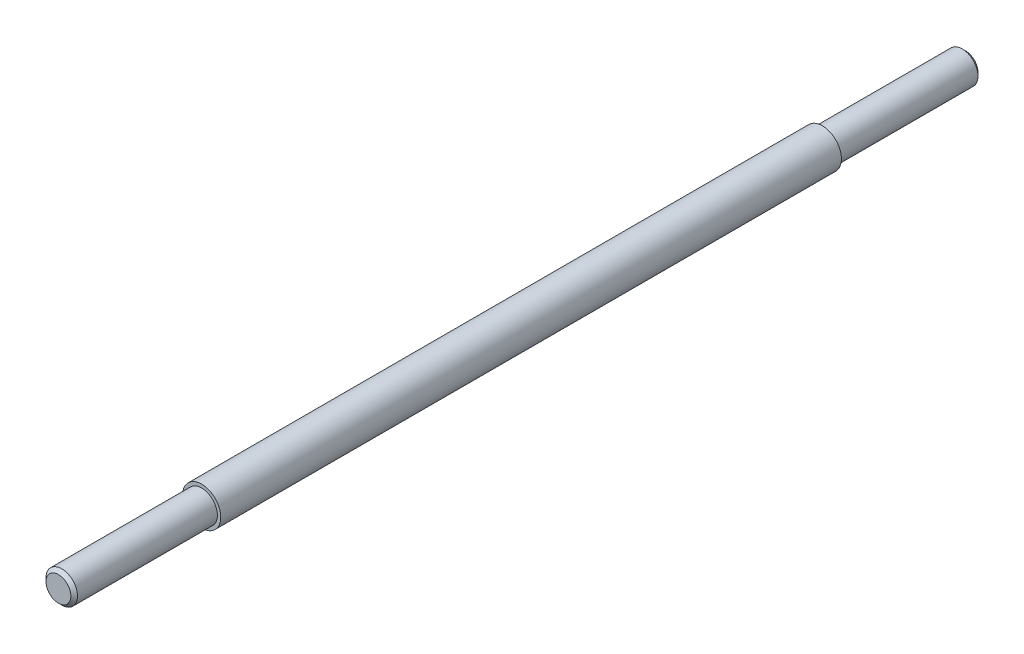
ISO-10303-21;
HEADER;
FILE_DESCRIPTION(('STEP AP214'),'2;1');
FILE_NAME('part.step','',(''),(''),'','','');
FILE_SCHEMA(('AUTOMOTIVE_DESIGN { 1 0 10303 214 1 1 1 1 }'));
ENDSEC;
DATA;
#1=APPLICATION_CONTEXT('core data for automotive mechanical design processes');
#2=APPLICATION_PROTOCOL_DEFINITION('international standard','automotive_design',2000,#1);
#3=PRODUCT_CONTEXT('',#1,'mechanical');
#4=PRODUCT('Part','Part','',(#3));
#5=PRODUCT_RELATED_PRODUCT_CATEGORY('part','',(#4));
#6=PRODUCT_DEFINITION_FORMATION('','',#4);
#7=PRODUCT_DEFINITION_CONTEXT('part definition',#1,'design');
#8=PRODUCT_DEFINITION('design','',#6,#7);
#9=PRODUCT_DEFINITION_SHAPE('','',#8);
#10=(LENGTH_UNIT() NAMED_UNIT(*) SI_UNIT(.MILLI.,.METRE.));
#11=(NAMED_UNIT(*) PLANE_ANGLE_UNIT() SI_UNIT($,.RADIAN.));
#12=(NAMED_UNIT(*) SI_UNIT($,.STERADIAN.) SOLID_ANGLE_UNIT());
#13=UNCERTAINTY_MEASURE_WITH_UNIT(LENGTH_MEASURE(1.E-05),#10,'distance_accuracy_value','');
#14=(GEOMETRIC_REPRESENTATION_CONTEXT(3) GLOBAL_UNCERTAINTY_ASSIGNED_CONTEXT((#13)) GLOBAL_UNIT_ASSIGNED_CONTEXT((#10,
#11,#12)) REPRESENTATION_CONTEXT('',''));
#15=CARTESIAN_POINT('',(0.,0.,0.));
#16=DIRECTION('',(0.,0.,1.));
#17=DIRECTION('',(1.,0.,0.));
#18=AXIS2_PLACEMENT_3D('',#15,#16,#17);
#19=CARTESIAN_POINT('',(0.,0.,95.));
#20=DIRECTION('',(0.,0.,-1.));
#21=DIRECTION('',(-1.,0.,0.));
#22=AXIS2_PLACEMENT_3D('',#19,#20,#21);
#23=CYLINDRICAL_SURFACE('',#22,2.);
#24=CARTESIAN_POINT('',(0.,0.,80.));
#25=DIRECTION('',(0.,0.,1.));
#26=DIRECTION('',(1.,0.,0.));
#27=AXIS2_PLACEMENT_3D('',#24,#25,#26);
#28=CIRCLE('',#27,2.);
#29=CARTESIAN_POINT('',(2.,0.,80.));
#30=VERTEX_POINT('',#29);
#31=EDGE_CURVE('E48',#30,#30,#28,.T.);
#32=ORIENTED_EDGE('',*,*,#31,.F.);
#33=EDGE_LOOP('',(#32));
#34=FACE_BOUND('',#33,.T.);
#35=CARTESIAN_POINT('',(0.,0.,15.));
#36=DIRECTION('',(0.,0.,-1.));
#37=DIRECTION('',(-1.,0.,0.));
#38=AXIS2_PLACEMENT_3D('',#35,#36,#37);
#39=CIRCLE('',#38,2.);
#40=CARTESIAN_POINT('',(-2.,0.,15.));
#41=VERTEX_POINT('',#40);
#42=EDGE_CURVE('E49',#41,#41,#39,.T.);
#43=ORIENTED_EDGE('',*,*,#42,.F.);
#44=EDGE_LOOP('',(#43));
#45=FACE_BOUND('',#44,.T.);
#46=ADVANCED_FACE('F28',(#34,#45),#23,.T.);
#47=CARTESIAN_POINT('',(0.,0.,80.));
#48=DIRECTION('',(0.,0.,1.));
#49=DIRECTION('',(1.,0.,0.));
#50=AXIS2_PLACEMENT_3D('',#47,#48,#49);
#51=PLANE('',#50);
#52=CARTESIAN_POINT('',(0.,0.,80.));
#53=DIRECTION('',(0.,0.,1.));
#54=DIRECTION('',(1.,0.,0.));
#55=AXIS2_PLACEMENT_3D('',#52,#53,#54);
#56=CIRCLE('',#55,1.65);
#57=CARTESIAN_POINT('',(1.65,0.,80.));
#58=VERTEX_POINT('',#57);
#59=EDGE_CURVE('E52',#58,#58,#56,.T.);
#60=ORIENTED_EDGE('',*,*,#59,.F.);
#61=EDGE_LOOP('',(#60));
#62=FACE_BOUND('',#61,.T.);
#63=ORIENTED_EDGE('',*,*,#31,.T.);
#64=EDGE_LOOP('',(#63));
#65=FACE_BOUND('',#64,.T.);
#66=ADVANCED_FACE('F71',(#62,#65),#51,.T.);
#67=CARTESIAN_POINT('',(0.,0.,80.));
#68=DIRECTION('',(0.,0.,1.));
#69=DIRECTION('',(1.,0.,0.));
#70=AXIS2_PLACEMENT_3D('',#67,#68,#69);
#71=CYLINDRICAL_SURFACE('',#70,1.65);
#72=CARTESIAN_POINT('',(0.,0.,94.65));
#73=DIRECTION('',(0.,0.,1.));
#74=DIRECTION('',(1.,0.,0.));
#75=AXIS2_PLACEMENT_3D('',#72,#73,#74);
#76=CIRCLE('',#75,1.65);
#77=CARTESIAN_POINT('',(1.65,0.,94.65));
#78=VERTEX_POINT('',#77);
#79=EDGE_CURVE('E39',#78,#78,#76,.F.);
#80=ORIENTED_EDGE('',*,*,#79,.T.);
#81=EDGE_LOOP('',(#80));
#82=FACE_BOUND('',#81,.T.);
#83=ORIENTED_EDGE('',*,*,#59,.T.);
#84=EDGE_LOOP('',(#83));
#85=FACE_BOUND('',#84,.T.);
#86=ADVANCED_FACE('F77',(#82,#85),#71,.T.);
#87=CARTESIAN_POINT('',(0.,0.,95.));
#88=DIRECTION('',(0.,0.,1.));
#89=DIRECTION('',(1.,0.,0.));
#90=AXIS2_PLACEMENT_3D('',#87,#88,#89);
#91=PLANE('',#90);
#92=CARTESIAN_POINT('',(0.,0.,95.));
#93=DIRECTION('',(0.,0.,1.));
#94=DIRECTION('',(1.,0.,0.));
#95=AXIS2_PLACEMENT_3D('',#92,#93,#94);
#96=CIRCLE('',#95,1.3);
#97=CARTESIAN_POINT('',(1.3,0.,95.));
#98=VERTEX_POINT('',#97);
#99=EDGE_CURVE('E43',#98,#98,#96,.T.);
#100=ORIENTED_EDGE('',*,*,#99,.T.);
#101=EDGE_LOOP('',(#100));
#102=FACE_BOUND('',#101,.T.);
#103=ADVANCED_FACE('F66',(#102),#91,.T.);
#104=CARTESIAN_POINT('',(0.,0.,15.));
#105=DIRECTION('',(0.,0.,-1.));
#106=DIRECTION('',(-1.,0.,0.));
#107=AXIS2_PLACEMENT_3D('',#104,#105,#106);
#108=PLANE('',#107);
#109=CARTESIAN_POINT('',(0.,0.,15.));
#110=DIRECTION('',(0.,0.,-1.));
#111=DIRECTION('',(-1.,0.,0.));
#112=AXIS2_PLACEMENT_3D('',#109,#110,#111);
#113=CIRCLE('',#112,1.65);
#114=CARTESIAN_POINT('',(-1.65,0.,15.));
#115=VERTEX_POINT('',#114);
#116=EDGE_CURVE('E53',#115,#115,#113,.T.);
#117=ORIENTED_EDGE('',*,*,#116,.F.);
#118=EDGE_LOOP('',(#117));
#119=FACE_BOUND('',#118,.T.);
#120=ORIENTED_EDGE('',*,*,#42,.T.);
#121=EDGE_LOOP('',(#120));
#122=FACE_BOUND('',#121,.T.);
#123=ADVANCED_FACE('F63',(#119,#122),#108,.T.);
#124=CARTESIAN_POINT('',(0.,0.,15.));
#125=DIRECTION('',(0.,0.,-1.));
#126=DIRECTION('',(-1.,0.,0.));
#127=AXIS2_PLACEMENT_3D('',#124,#125,#126);
#128=CYLINDRICAL_SURFACE('',#127,1.65);
#129=CARTESIAN_POINT('',(0.,0.,0.349999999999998));
#130=DIRECTION('',(0.,0.,1.));
#131=DIRECTION('',(1.,0.,0.));
#132=AXIS2_PLACEMENT_3D('',#129,#130,#131);
#133=CIRCLE('',#132,1.65);
#134=CARTESIAN_POINT('',(1.65,0.,0.349999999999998));
#135=VERTEX_POINT('',#134);
#136=EDGE_CURVE('E10',#135,#135,#133,.T.);
#137=ORIENTED_EDGE('',*,*,#136,.T.);
#138=EDGE_LOOP('',(#137));
#139=FACE_BOUND('',#138,.T.);
#140=ORIENTED_EDGE('',*,*,#116,.T.);
#141=EDGE_LOOP('',(#140));
#142=FACE_BOUND('',#141,.T.);
#143=ADVANCED_FACE('F61',(#139,#142),#128,.T.);
#144=CARTESIAN_POINT('',(0.,0.,0.));
#145=DIRECTION('',(0.,0.,1.));
#146=DIRECTION('',(1.,0.,0.));
#147=AXIS2_PLACEMENT_3D('',#144,#145,#146);
#148=PLANE('',#147);
#149=CARTESIAN_POINT('',(0.,0.,0.));
#150=DIRECTION('',(0.,0.,1.));
#151=DIRECTION('',(1.,0.,0.));
#152=AXIS2_PLACEMENT_3D('',#149,#150,#151);
#153=CIRCLE('',#152,1.3);
#154=CARTESIAN_POINT('',(1.3,0.,0.));
#155=VERTEX_POINT('',#154);
#156=EDGE_CURVE('E35',#155,#155,#153,.F.);
#157=ORIENTED_EDGE('',*,*,#156,.T.);
#158=EDGE_LOOP('',(#157));
#159=FACE_BOUND('',#158,.T.);
#160=ADVANCED_FACE('F82',(#159),#148,.F.);
#161=CARTESIAN_POINT('',(0.,0.,95.));
#162=DIRECTION('',(0.,0.,-1.));
#163=DIRECTION('',(-1.,0.,0.));
#164=AXIS2_PLACEMENT_3D('',#161,#162,#163);
#165=CONICAL_SURFACE('',#164,1.3,0.78539816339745);
#166=ORIENTED_EDGE('',*,*,#79,.F.);
#167=EDGE_LOOP('',(#166));
#168=FACE_BOUND('',#167,.T.);
#169=ORIENTED_EDGE('',*,*,#99,.F.);
#170=EDGE_LOOP('',(#169));
#171=FACE_BOUND('',#170,.T.);
#172=ADVANCED_FACE('F84',(#168,#171),#165,.T.);
#173=CARTESIAN_POINT('',(0.,0.,0.));
#174=DIRECTION('',(0.,0.,1.));
#175=DIRECTION('',(1.,0.,0.));
#176=AXIS2_PLACEMENT_3D('',#173,#174,#175);
#177=CONICAL_SURFACE('',#176,1.3,0.785398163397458);
#178=ORIENTED_EDGE('',*,*,#136,.F.);
#179=EDGE_LOOP('',(#178));
#180=FACE_BOUND('',#179,.T.);
#181=ORIENTED_EDGE('',*,*,#156,.F.);
#182=EDGE_LOOP('',(#181));
#183=FACE_BOUND('',#182,.T.);
#184=ADVANCED_FACE('F30',(#180,#183),#177,.T.);
#185=CLOSED_SHELL('',(#46,#66,#86,#103,#123,#143,#160,#172,#184));
#186=MANIFOLD_SOLID_BREP('B2',#185);
#187=ADVANCED_BREP_SHAPE_REPRESENTATION('',(#18,#186),#14);
#188=SHAPE_DEFINITION_REPRESENTATION(#9,#187);
ENDSEC;
END-ISO-10303-21;
